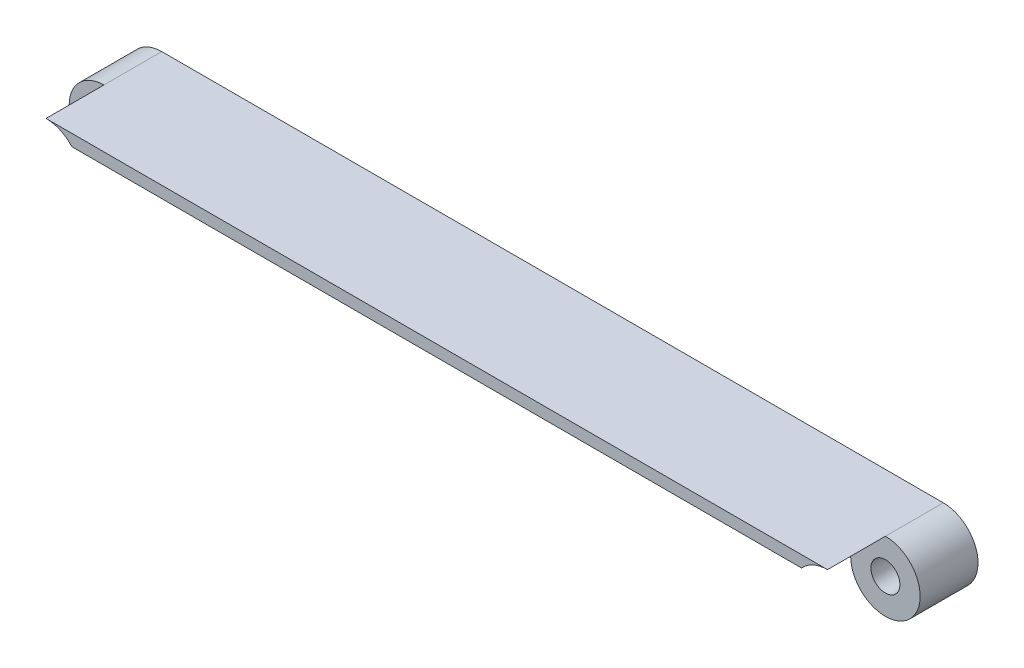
from build123d import *

# Parameters (mm, degrees)
ESQUISSE1_R             = 2.5
BOSS_EXTRU_1_DEPTH      = 20
ENL_V_START             = -10
ESQUISSE2_R             = 6
ENL_V_MAT_EXTRU_1_DEPTH = 10


with BuildPart() as part:
    # Esquisse1 → Boss.-Extru.1 (new body)
    with BuildSketch(Plane.XY):
        with BuildLine():
            Line((-135, 6), (0, 6))
            ThreePointArc((0, 6), (2.449489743, -5.477225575), (-4.472135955, 4))
            Line((-4.472135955, 4), (-130.527864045, 4))
            ThreePointArc((-130.527864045, 4), (-137.449489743, -5.477225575), (-135, 6))
        make_face()
        with Locations((-135, 0)):
            Circle(ESQUISSE1_R, mode=Mode.SUBTRACT)
        Circle(ESQUISSE1_R, mode=Mode.SUBTRACT)
    extrude(amount=BOSS_EXTRU_1_DEPTH)

    # Esquisse2 → Enl_v. mat.-Extru.1 (cut)
    with BuildSketch(Plane.XY.offset(20).offset(ENL_V_START)):
        Circle(ESQUISSE2_R)
        with Locations((-135, 0)):
            Circle(ESQUISSE2_R)
    extrude(amount=ENL_V_MAT_EXTRU_1_DEPTH, mode=Mode.SUBTRACT)


solid = part.part
